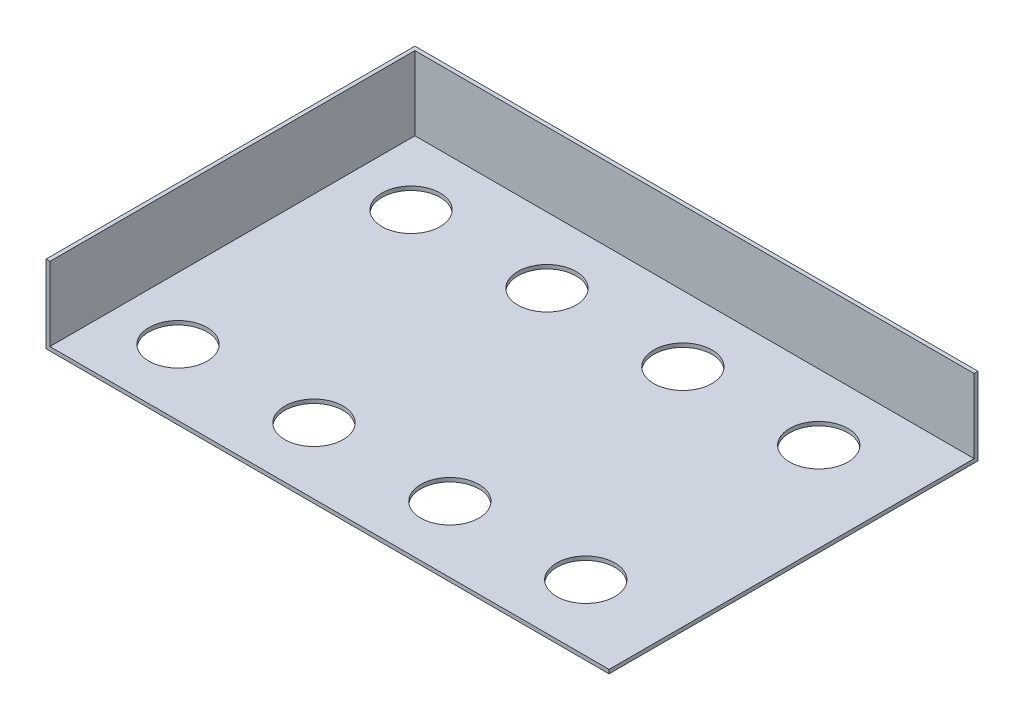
ISO-10303-21;
HEADER;
FILE_DESCRIPTION(('STEP AP214'),'2;1');
FILE_NAME('part.step','',(''),(''),'','','');
FILE_SCHEMA(('AUTOMOTIVE_DESIGN { 1 0 10303 214 1 1 1 1 }'));
ENDSEC;
DATA;
#1=APPLICATION_CONTEXT('core data for automotive mechanical design processes');
#2=APPLICATION_PROTOCOL_DEFINITION('international standard','automotive_design',2000,#1);
#3=PRODUCT_CONTEXT('',#1,'mechanical');
#4=PRODUCT('Part','Part','',(#3));
#5=PRODUCT_RELATED_PRODUCT_CATEGORY('part','',(#4));
#6=PRODUCT_DEFINITION_FORMATION('','',#4);
#7=PRODUCT_DEFINITION_CONTEXT('part definition',#1,'design');
#8=PRODUCT_DEFINITION('design','',#6,#7);
#9=PRODUCT_DEFINITION_SHAPE('','',#8);
#10=(LENGTH_UNIT() NAMED_UNIT(*) SI_UNIT(.MILLI.,.METRE.));
#11=(NAMED_UNIT(*) PLANE_ANGLE_UNIT() SI_UNIT($,.RADIAN.));
#12=(NAMED_UNIT(*) SI_UNIT($,.STERADIAN.) SOLID_ANGLE_UNIT());
#13=UNCERTAINTY_MEASURE_WITH_UNIT(LENGTH_MEASURE(1.E-05),#10,'distance_accuracy_value','');
#14=(GEOMETRIC_REPRESENTATION_CONTEXT(3) GLOBAL_UNCERTAINTY_ASSIGNED_CONTEXT((#13)) GLOBAL_UNIT_ASSIGNED_CONTEXT((#10,
#11,#12)) REPRESENTATION_CONTEXT('',''));
#15=CARTESIAN_POINT('',(0.,0.,0.));
#16=DIRECTION('',(0.,0.,1.));
#17=DIRECTION('',(1.,0.,0.));
#18=AXIS2_PLACEMENT_3D('',#15,#16,#17);
#19=CARTESIAN_POINT('',(-72.5,20.,47.5));
#20=DIRECTION('',(0.,0.,-1.));
#21=DIRECTION('',(-1.,0.,0.));
#22=AXIS2_PLACEMENT_3D('',#19,#20,#21);
#23=PLANE('',#22);
#24=DIRECTION('',(1.,0.,0.));
#25=VECTOR('',#24,1.);
#26=CARTESIAN_POINT('',(-72.5,1.,47.5));
#27=LINE('',#26,#25);
#28=CARTESIAN_POINT('',(-71.5,1.,47.5));
#29=VERTEX_POINT('',#28);
#30=CARTESIAN_POINT('',(72.5,1.,47.5));
#31=VERTEX_POINT('',#30);
#32=EDGE_CURVE('E122',#29,#31,#27,.T.);
#33=ORIENTED_EDGE('',*,*,#32,.F.);
#34=DIRECTION('',(0.,-1.,0.));
#35=VECTOR('',#34,1.);
#36=CARTESIAN_POINT('',(-71.5,20.,47.5));
#37=LINE('',#36,#35);
#38=CARTESIAN_POINT('',(-71.5,20.,47.5));
#39=VERTEX_POINT('',#38);
#40=EDGE_CURVE('E121',#39,#29,#37,.T.);
#41=ORIENTED_EDGE('',*,*,#40,.F.);
#42=DIRECTION('',(1.,0.,0.));
#43=VECTOR('',#42,1.);
#44=CARTESIAN_POINT('',(-72.5,20.,47.5));
#45=LINE('',#44,#43);
#46=CARTESIAN_POINT('',(-72.5,20.,47.5));
#47=VERTEX_POINT('',#46);
#48=EDGE_CURVE('E84',#47,#39,#45,.T.);
#49=ORIENTED_EDGE('',*,*,#48,.F.);
#50=DIRECTION('',(0.,-1.,0.));
#51=VECTOR('',#50,1.);
#52=CARTESIAN_POINT('',(-72.5,20.,47.5));
#53=LINE('',#52,#51);
#54=CARTESIAN_POINT('',(-72.5,0.,47.5));
#55=VERTEX_POINT('',#54);
#56=EDGE_CURVE('E11',#47,#55,#53,.T.);
#57=ORIENTED_EDGE('',*,*,#56,.T.);
#58=DIRECTION('',(1.,0.,0.));
#59=VECTOR('',#58,1.);
#60=CARTESIAN_POINT('',(-72.5,0.,47.5));
#61=LINE('',#60,#59);
#62=CARTESIAN_POINT('',(72.5,0.,47.5));
#63=VERTEX_POINT('',#62);
#64=EDGE_CURVE('E147',#55,#63,#61,.T.);
#65=ORIENTED_EDGE('',*,*,#64,.T.);
#66=DIRECTION('',(0.,-1.,0.));
#67=VECTOR('',#66,1.);
#68=CARTESIAN_POINT('',(72.5,20.,47.5));
#69=LINE('',#68,#67);
#70=EDGE_CURVE('E41',#31,#63,#69,.T.);
#71=ORIENTED_EDGE('',*,*,#70,.F.);
#72=EDGE_LOOP('',(#33,#41,#49,#57,#65,#71));
#73=FACE_BOUND('',#72,.T.);
#74=ADVANCED_FACE('F32',(#73),#23,.F.);
#75=CARTESIAN_POINT('',(72.5,20.,-47.5));
#76=DIRECTION('',(-1.,0.,0.));
#77=DIRECTION('',(0.,0.,1.));
#78=AXIS2_PLACEMENT_3D('',#75,#76,#77);
#79=PLANE('',#78);
#80=DIRECTION('',(0.,0.,-1.));
#81=VECTOR('',#80,1.);
#82=CARTESIAN_POINT('',(72.5,1.,-47.5));
#83=LINE('',#82,#81);
#84=CARTESIAN_POINT('',(72.5,1.,-46.5));
#85=VERTEX_POINT('',#84);
#86=EDGE_CURVE('E110',#31,#85,#83,.T.);
#87=ORIENTED_EDGE('',*,*,#86,.F.);
#88=ORIENTED_EDGE('',*,*,#70,.T.);
#89=DIRECTION('',(0.,0.,-1.));
#90=VECTOR('',#89,1.);
#91=CARTESIAN_POINT('',(72.5,0.,-47.5));
#92=LINE('',#91,#90);
#93=CARTESIAN_POINT('',(72.5,0.,-47.5));
#94=VERTEX_POINT('',#93);
#95=EDGE_CURVE('E150',#63,#94,#92,.T.);
#96=ORIENTED_EDGE('',*,*,#95,.T.);
#97=DIRECTION('',(0.,-1.,0.));
#98=VECTOR('',#97,1.);
#99=CARTESIAN_POINT('',(72.5,20.,-47.5));
#100=LINE('',#99,#98);
#101=CARTESIAN_POINT('',(72.5,20.,-47.5));
#102=VERTEX_POINT('',#101);
#103=EDGE_CURVE('E154',#102,#94,#100,.T.);
#104=ORIENTED_EDGE('',*,*,#103,.F.);
#105=DIRECTION('',(0.,0.,-1.));
#106=VECTOR('',#105,1.);
#107=CARTESIAN_POINT('',(72.5,20.,-47.5));
#108=LINE('',#107,#106);
#109=CARTESIAN_POINT('',(72.5,20.,-46.5));
#110=VERTEX_POINT('',#109);
#111=EDGE_CURVE('E141',#110,#102,#108,.T.);
#112=ORIENTED_EDGE('',*,*,#111,.F.);
#113=DIRECTION('',(0.,-1.,0.));
#114=VECTOR('',#113,1.);
#115=CARTESIAN_POINT('',(72.5,20.,-46.5));
#116=LINE('',#115,#114);
#117=EDGE_CURVE('E49',#110,#85,#116,.T.);
#118=ORIENTED_EDGE('',*,*,#117,.T.);
#119=EDGE_LOOP('',(#87,#88,#96,#104,#112,#118));
#120=FACE_BOUND('',#119,.T.);
#121=ADVANCED_FACE('F218',(#120),#79,.F.);
#122=CARTESIAN_POINT('',(-72.5,20.,-47.5));
#123=DIRECTION('',(1.,0.,0.));
#124=DIRECTION('',(0.,0.,-1.));
#125=AXIS2_PLACEMENT_3D('',#122,#123,#124);
#126=PLANE('',#125);
#127=DIRECTION('',(0.,0.,1.));
#128=VECTOR('',#127,1.);
#129=CARTESIAN_POINT('',(-72.5,0.,-47.5));
#130=LINE('',#129,#128);
#131=CARTESIAN_POINT('',(-72.5,0.,-47.5));
#132=VERTEX_POINT('',#131);
#133=EDGE_CURVE('E132',#132,#55,#130,.T.);
#134=ORIENTED_EDGE('',*,*,#133,.T.);
#135=ORIENTED_EDGE('',*,*,#56,.F.);
#136=DIRECTION('',(0.,0.,1.));
#137=VECTOR('',#136,1.);
#138=CARTESIAN_POINT('',(-72.5,20.,-47.5));
#139=LINE('',#138,#137);
#140=CARTESIAN_POINT('',(-72.5,20.,-47.5));
#141=VERTEX_POINT('',#140);
#142=EDGE_CURVE('E138',#141,#47,#139,.T.);
#143=ORIENTED_EDGE('',*,*,#142,.F.);
#144=DIRECTION('',(0.,-1.,0.));
#145=VECTOR('',#144,1.);
#146=CARTESIAN_POINT('',(-72.5,20.,-47.5));
#147=LINE('',#146,#145);
#148=EDGE_CURVE('E144',#141,#132,#147,.T.);
#149=ORIENTED_EDGE('',*,*,#148,.T.);
#150=EDGE_LOOP('',(#134,#135,#143,#149));
#151=FACE_BOUND('',#150,.T.);
#152=ADVANCED_FACE('F34',(#151),#126,.F.);
#153=CARTESIAN_POINT('',(-72.5,20.,-47.5));
#154=DIRECTION('',(0.,0.,1.));
#155=DIRECTION('',(1.,0.,0.));
#156=AXIS2_PLACEMENT_3D('',#153,#154,#155);
#157=PLANE('',#156);
#158=DIRECTION('',(-1.,0.,0.));
#159=VECTOR('',#158,1.);
#160=CARTESIAN_POINT('',(-72.5,0.,-47.5));
#161=LINE('',#160,#159);
#162=EDGE_CURVE('E78',#94,#132,#161,.T.);
#163=ORIENTED_EDGE('',*,*,#162,.T.);
#164=ORIENTED_EDGE('',*,*,#148,.F.);
#165=DIRECTION('',(-1.,0.,0.));
#166=VECTOR('',#165,1.);
#167=CARTESIAN_POINT('',(-72.5,20.,-47.5));
#168=LINE('',#167,#166);
#169=EDGE_CURVE('E58',#102,#141,#168,.T.);
#170=ORIENTED_EDGE('',*,*,#169,.F.);
#171=ORIENTED_EDGE('',*,*,#103,.T.);
#172=EDGE_LOOP('',(#163,#164,#170,#171));
#173=FACE_BOUND('',#172,.T.);
#174=ADVANCED_FACE('F225',(#173),#157,.F.);
#175=CARTESIAN_POINT('',(-72.5,20.,47.5));
#176=DIRECTION('',(0.,1.,0.));
#177=DIRECTION('',(0.,0.,1.));
#178=AXIS2_PLACEMENT_3D('',#175,#176,#177);
#179=PLANE('',#178);
#180=DIRECTION('',(0.,0.,1.));
#181=VECTOR('',#180,1.);
#182=CARTESIAN_POINT('',(-71.5,20.,-47.5));
#183=LINE('',#182,#181);
#184=CARTESIAN_POINT('',(-71.5,20.,-46.5));
#185=VERTEX_POINT('',#184);
#186=EDGE_CURVE('E111',#185,#39,#183,.T.);
#187=ORIENTED_EDGE('',*,*,#186,.F.);
#188=DIRECTION('',(-1.,0.,0.));
#189=VECTOR('',#188,1.);
#190=CARTESIAN_POINT('',(-72.5,20.,-46.5));
#191=LINE('',#190,#189);
#192=EDGE_CURVE('E116',#110,#185,#191,.T.);
#193=ORIENTED_EDGE('',*,*,#192,.F.);
#194=ORIENTED_EDGE('',*,*,#111,.T.);
#195=ORIENTED_EDGE('',*,*,#169,.T.);
#196=ORIENTED_EDGE('',*,*,#142,.T.);
#197=ORIENTED_EDGE('',*,*,#48,.T.);
#198=EDGE_LOOP('',(#187,#193,#194,#195,#196,#197));
#199=FACE_BOUND('',#198,.T.);
#200=ADVANCED_FACE('F228',(#199),#179,.T.);
#201=CARTESIAN_POINT('',(-72.5,0.,47.5));
#202=DIRECTION('',(0.,1.,0.));
#203=DIRECTION('',(0.,0.,1.));
#204=AXIS2_PLACEMENT_3D('',#201,#202,#203);
#205=PLANE('',#204);
#206=CARTESIAN_POINT('',(49.5,0.,-29.5));
#207=DIRECTION('',(0.,1.,0.));
#208=DIRECTION('',(0.,0.,1.));
#209=AXIS2_PLACEMENT_3D('',#206,#207,#208);
#210=CIRCLE('',#209,7.5);
#211=CARTESIAN_POINT('',(49.5,0.,-22.));
#212=VERTEX_POINT('',#211);
#213=EDGE_CURVE('E188',#212,#212,#210,.T.);
#214=ORIENTED_EDGE('',*,*,#213,.T.);
#215=EDGE_LOOP('',(#214));
#216=FACE_BOUND('',#215,.T.);
#217=CARTESIAN_POINT('',(49.5,0.,30.5));
#218=DIRECTION('',(0.,1.,0.));
#219=DIRECTION('',(0.,0.,1.));
#220=AXIS2_PLACEMENT_3D('',#217,#218,#219);
#221=CIRCLE('',#220,7.5);
#222=CARTESIAN_POINT('',(49.5,0.,38.));
#223=VERTEX_POINT('',#222);
#224=EDGE_CURVE('E178',#223,#223,#221,.T.);
#225=ORIENTED_EDGE('',*,*,#224,.T.);
#226=EDGE_LOOP('',(#225));
#227=FACE_BOUND('',#226,.T.);
#228=CARTESIAN_POINT('',(14.5,0.,-29.5));
#229=DIRECTION('',(0.,1.,0.));
#230=DIRECTION('',(0.,0.,1.));
#231=AXIS2_PLACEMENT_3D('',#228,#229,#230);
#232=CIRCLE('',#231,7.5);
#233=CARTESIAN_POINT('',(14.5,0.,-22.));
#234=VERTEX_POINT('',#233);
#235=EDGE_CURVE('E175',#234,#234,#232,.T.);
#236=ORIENTED_EDGE('',*,*,#235,.T.);
#237=EDGE_LOOP('',(#236));
#238=FACE_BOUND('',#237,.T.);
#239=CARTESIAN_POINT('',(14.5,0.,30.5));
#240=DIRECTION('',(0.,1.,0.));
#241=DIRECTION('',(0.,0.,1.));
#242=AXIS2_PLACEMENT_3D('',#239,#240,#241);
#243=CIRCLE('',#242,7.5);
#244=CARTESIAN_POINT('',(14.5,0.,38.));
#245=VERTEX_POINT('',#244);
#246=EDGE_CURVE('E172',#245,#245,#243,.T.);
#247=ORIENTED_EDGE('',*,*,#246,.T.);
#248=EDGE_LOOP('',(#247));
#249=FACE_BOUND('',#248,.T.);
#250=CARTESIAN_POINT('',(-20.5,0.,-29.5));
#251=DIRECTION('',(0.,1.,0.));
#252=DIRECTION('',(0.,0.,1.));
#253=AXIS2_PLACEMENT_3D('',#250,#251,#252);
#254=CIRCLE('',#253,7.5);
#255=CARTESIAN_POINT('',(-20.5,0.,-22.));
#256=VERTEX_POINT('',#255);
#257=EDGE_CURVE('E168',#256,#256,#254,.T.);
#258=ORIENTED_EDGE('',*,*,#257,.T.);
#259=EDGE_LOOP('',(#258));
#260=FACE_BOUND('',#259,.T.);
#261=CARTESIAN_POINT('',(-20.5,0.,30.5));
#262=DIRECTION('',(0.,1.,0.));
#263=DIRECTION('',(0.,0.,1.));
#264=AXIS2_PLACEMENT_3D('',#261,#262,#263);
#265=CIRCLE('',#264,7.5);
#266=CARTESIAN_POINT('',(-20.5,0.,38.));
#267=VERTEX_POINT('',#266);
#268=EDGE_CURVE('E164',#267,#267,#265,.T.);
#269=ORIENTED_EDGE('',*,*,#268,.T.);
#270=EDGE_LOOP('',(#269));
#271=FACE_BOUND('',#270,.T.);
#272=CARTESIAN_POINT('',(-55.5,0.,-29.5));
#273=DIRECTION('',(0.,1.,0.));
#274=DIRECTION('',(0.,0.,1.));
#275=AXIS2_PLACEMENT_3D('',#272,#273,#274);
#276=CIRCLE('',#275,7.5);
#277=CARTESIAN_POINT('',(-55.5,0.,-22.));
#278=VERTEX_POINT('',#277);
#279=EDGE_CURVE('E160',#278,#278,#276,.T.);
#280=ORIENTED_EDGE('',*,*,#279,.T.);
#281=EDGE_LOOP('',(#280));
#282=FACE_BOUND('',#281,.T.);
#283=CARTESIAN_POINT('',(-55.5,0.,30.5));
#284=DIRECTION('',(0.,1.,0.));
#285=DIRECTION('',(0.,0.,1.));
#286=AXIS2_PLACEMENT_3D('',#283,#284,#285);
#287=CIRCLE('',#286,7.5);
#288=CARTESIAN_POINT('',(-55.5,0.,38.));
#289=VERTEX_POINT('',#288);
#290=EDGE_CURVE('E127',#289,#289,#287,.T.);
#291=ORIENTED_EDGE('',*,*,#290,.T.);
#292=EDGE_LOOP('',(#291));
#293=FACE_BOUND('',#292,.T.);
#294=ORIENTED_EDGE('',*,*,#133,.F.);
#295=ORIENTED_EDGE('',*,*,#162,.F.);
#296=ORIENTED_EDGE('',*,*,#95,.F.);
#297=ORIENTED_EDGE('',*,*,#64,.F.);
#298=EDGE_LOOP('',(#294,#295,#296,#297));
#299=FACE_BOUND('',#298,.T.);
#300=ADVANCED_FACE('F199',(#216,#227,#238,#249,#260,#271,#282,#293,#299),#205,.F.);
#301=CARTESIAN_POINT('',(-71.5,20.,-47.5));
#302=DIRECTION('',(1.,0.,0.));
#303=DIRECTION('',(0.,0.,-1.));
#304=AXIS2_PLACEMENT_3D('',#301,#302,#303);
#305=PLANE('',#304);
#306=DIRECTION('',(0.,0.,1.));
#307=VECTOR('',#306,1.);
#308=CARTESIAN_POINT('',(-71.5,1.,-47.5));
#309=LINE('',#308,#307);
#310=CARTESIAN_POINT('',(-71.5,1.,-46.5));
#311=VERTEX_POINT('',#310);
#312=EDGE_CURVE('E107',#311,#29,#309,.T.);
#313=ORIENTED_EDGE('',*,*,#312,.F.);
#314=DIRECTION('',(0.,-1.,0.));
#315=VECTOR('',#314,1.);
#316=CARTESIAN_POINT('',(-71.5,20.,-46.5));
#317=LINE('',#316,#315);
#318=EDGE_CURVE('E114',#185,#311,#317,.T.);
#319=ORIENTED_EDGE('',*,*,#318,.F.);
#320=ORIENTED_EDGE('',*,*,#186,.T.);
#321=ORIENTED_EDGE('',*,*,#40,.T.);
#322=EDGE_LOOP('',(#313,#319,#320,#321));
#323=FACE_BOUND('',#322,.T.);
#324=ADVANCED_FACE('F120',(#323),#305,.T.);
#325=CARTESIAN_POINT('',(-72.5,20.,-46.5));
#326=DIRECTION('',(0.,0.,1.));
#327=DIRECTION('',(1.,0.,0.));
#328=AXIS2_PLACEMENT_3D('',#325,#326,#327);
#329=PLANE('',#328);
#330=DIRECTION('',(-1.,0.,0.));
#331=VECTOR('',#330,1.);
#332=CARTESIAN_POINT('',(-72.5,1.,-46.5));
#333=LINE('',#332,#331);
#334=EDGE_CURVE('E103',#85,#311,#333,.T.);
#335=ORIENTED_EDGE('',*,*,#334,.F.);
#336=ORIENTED_EDGE('',*,*,#117,.F.);
#337=ORIENTED_EDGE('',*,*,#192,.T.);
#338=ORIENTED_EDGE('',*,*,#318,.T.);
#339=EDGE_LOOP('',(#335,#336,#337,#338));
#340=FACE_BOUND('',#339,.T.);
#341=ADVANCED_FACE('F115',(#340),#329,.T.);
#342=CARTESIAN_POINT('',(-72.5,1.,47.5));
#343=DIRECTION('',(0.,1.,0.));
#344=DIRECTION('',(0.,0.,1.));
#345=AXIS2_PLACEMENT_3D('',#342,#343,#344);
#346=PLANE('',#345);
#347=CARTESIAN_POINT('',(49.5,1.,-29.5));
#348=DIRECTION('',(0.,1.,0.));
#349=DIRECTION('',(0.,0.,1.));
#350=AXIS2_PLACEMENT_3D('',#347,#348,#349);
#351=CIRCLE('',#350,7.5);
#352=CARTESIAN_POINT('',(49.5,1.,-22.));
#353=VERTEX_POINT('',#352);
#354=EDGE_CURVE('E36',#353,#353,#351,.T.);
#355=ORIENTED_EDGE('',*,*,#354,.F.);
#356=EDGE_LOOP('',(#355));
#357=FACE_BOUND('',#356,.T.);
#358=CARTESIAN_POINT('',(49.5,1.,30.5));
#359=DIRECTION('',(0.,1.,0.));
#360=DIRECTION('',(0.,0.,1.));
#361=AXIS2_PLACEMENT_3D('',#358,#359,#360);
#362=CIRCLE('',#361,7.5);
#363=CARTESIAN_POINT('',(49.5,1.,38.));
#364=VERTEX_POINT('',#363);
#365=EDGE_CURVE('E176',#364,#364,#362,.T.);
#366=ORIENTED_EDGE('',*,*,#365,.F.);
#367=EDGE_LOOP('',(#366));
#368=FACE_BOUND('',#367,.T.);
#369=CARTESIAN_POINT('',(14.5,1.,-29.5));
#370=DIRECTION('',(0.,1.,0.));
#371=DIRECTION('',(0.,0.,1.));
#372=AXIS2_PLACEMENT_3D('',#369,#370,#371);
#373=CIRCLE('',#372,7.5);
#374=CARTESIAN_POINT('',(14.5,1.,-22.));
#375=VERTEX_POINT('',#374);
#376=EDGE_CURVE('E173',#375,#375,#373,.T.);
#377=ORIENTED_EDGE('',*,*,#376,.F.);
#378=EDGE_LOOP('',(#377));
#379=FACE_BOUND('',#378,.T.);
#380=CARTESIAN_POINT('',(14.5,1.,30.5));
#381=DIRECTION('',(0.,1.,0.));
#382=DIRECTION('',(0.,0.,1.));
#383=AXIS2_PLACEMENT_3D('',#380,#381,#382);
#384=CIRCLE('',#383,7.5);
#385=CARTESIAN_POINT('',(14.5,1.,38.));
#386=VERTEX_POINT('',#385);
#387=EDGE_CURVE('E169',#386,#386,#384,.T.);
#388=ORIENTED_EDGE('',*,*,#387,.F.);
#389=EDGE_LOOP('',(#388));
#390=FACE_BOUND('',#389,.T.);
#391=CARTESIAN_POINT('',(-20.5,1.,-29.5));
#392=DIRECTION('',(0.,1.,0.));
#393=DIRECTION('',(0.,0.,1.));
#394=AXIS2_PLACEMENT_3D('',#391,#392,#393);
#395=CIRCLE('',#394,7.5);
#396=CARTESIAN_POINT('',(-20.5,1.,-22.));
#397=VERTEX_POINT('',#396);
#398=EDGE_CURVE('E165',#397,#397,#395,.T.);
#399=ORIENTED_EDGE('',*,*,#398,.F.);
#400=EDGE_LOOP('',(#399));
#401=FACE_BOUND('',#400,.T.);
#402=CARTESIAN_POINT('',(-20.5,1.,30.5));
#403=DIRECTION('',(0.,1.,0.));
#404=DIRECTION('',(0.,0.,1.));
#405=AXIS2_PLACEMENT_3D('',#402,#403,#404);
#406=CIRCLE('',#405,7.5);
#407=CARTESIAN_POINT('',(-20.5,1.,38.));
#408=VERTEX_POINT('',#407);
#409=EDGE_CURVE('E161',#408,#408,#406,.T.);
#410=ORIENTED_EDGE('',*,*,#409,.F.);
#411=EDGE_LOOP('',(#410));
#412=FACE_BOUND('',#411,.T.);
#413=CARTESIAN_POINT('',(-55.5,1.,-29.5));
#414=DIRECTION('',(0.,1.,0.));
#415=DIRECTION('',(0.,0.,1.));
#416=AXIS2_PLACEMENT_3D('',#413,#414,#415);
#417=CIRCLE('',#416,7.5);
#418=CARTESIAN_POINT('',(-55.5,1.,-22.));
#419=VERTEX_POINT('',#418);
#420=EDGE_CURVE('E157',#419,#419,#417,.T.);
#421=ORIENTED_EDGE('',*,*,#420,.F.);
#422=EDGE_LOOP('',(#421));
#423=FACE_BOUND('',#422,.T.);
#424=CARTESIAN_POINT('',(-55.5,1.,30.5));
#425=DIRECTION('',(0.,1.,0.));
#426=DIRECTION('',(0.,0.,1.));
#427=AXIS2_PLACEMENT_3D('',#424,#425,#426);
#428=CIRCLE('',#427,7.5);
#429=CARTESIAN_POINT('',(-55.5,1.,38.));
#430=VERTEX_POINT('',#429);
#431=EDGE_CURVE('E123',#430,#430,#428,.T.);
#432=ORIENTED_EDGE('',*,*,#431,.F.);
#433=EDGE_LOOP('',(#432));
#434=FACE_BOUND('',#433,.T.);
#435=ORIENTED_EDGE('',*,*,#312,.T.);
#436=ORIENTED_EDGE('',*,*,#32,.T.);
#437=ORIENTED_EDGE('',*,*,#86,.T.);
#438=ORIENTED_EDGE('',*,*,#334,.T.);
#439=EDGE_LOOP('',(#435,#436,#437,#438));
#440=FACE_BOUND('',#439,.T.);
#441=ADVANCED_FACE('F105',(#357,#368,#379,#390,#401,#412,#423,#434,#440),#346,.T.);
#442=CARTESIAN_POINT('',(-55.5,0.,30.5));
#443=DIRECTION('',(0.,1.,0.));
#444=DIRECTION('',(0.,0.,1.));
#445=AXIS2_PLACEMENT_3D('',#442,#443,#444);
#446=CYLINDRICAL_SURFACE('',#445,7.5);
#447=ORIENTED_EDGE('',*,*,#431,.T.);
#448=EDGE_LOOP('',(#447));
#449=FACE_BOUND('',#448,.T.);
#450=ORIENTED_EDGE('',*,*,#290,.F.);
#451=EDGE_LOOP('',(#450));
#452=FACE_BOUND('',#451,.T.);
#453=ADVANCED_FACE('F205',(#449,#452),#446,.F.);
#454=CARTESIAN_POINT('',(-55.5,0.,-29.5));
#455=DIRECTION('',(0.,1.,0.));
#456=DIRECTION('',(0.,0.,1.));
#457=AXIS2_PLACEMENT_3D('',#454,#455,#456);
#458=CYLINDRICAL_SURFACE('',#457,7.5);
#459=ORIENTED_EDGE('',*,*,#420,.T.);
#460=EDGE_LOOP('',(#459));
#461=FACE_BOUND('',#460,.T.);
#462=ORIENTED_EDGE('',*,*,#279,.F.);
#463=EDGE_LOOP('',(#462));
#464=FACE_BOUND('',#463,.T.);
#465=ADVANCED_FACE('F202',(#461,#464),#458,.F.);
#466=CARTESIAN_POINT('',(-20.5,0.,30.5));
#467=DIRECTION('',(0.,1.,0.));
#468=DIRECTION('',(0.,0.,1.));
#469=AXIS2_PLACEMENT_3D('',#466,#467,#468);
#470=CYLINDRICAL_SURFACE('',#469,7.5);
#471=ORIENTED_EDGE('',*,*,#409,.T.);
#472=EDGE_LOOP('',(#471));
#473=FACE_BOUND('',#472,.T.);
#474=ORIENTED_EDGE('',*,*,#268,.F.);
#475=EDGE_LOOP('',(#474));
#476=FACE_BOUND('',#475,.T.);
#477=ADVANCED_FACE('F204',(#473,#476),#470,.F.);
#478=CARTESIAN_POINT('',(-20.5,0.,-29.5));
#479=DIRECTION('',(0.,1.,0.));
#480=DIRECTION('',(0.,0.,1.));
#481=AXIS2_PLACEMENT_3D('',#478,#479,#480);
#482=CYLINDRICAL_SURFACE('',#481,7.5);
#483=ORIENTED_EDGE('',*,*,#398,.T.);
#484=EDGE_LOOP('',(#483));
#485=FACE_BOUND('',#484,.T.);
#486=ORIENTED_EDGE('',*,*,#257,.F.);
#487=EDGE_LOOP('',(#486));
#488=FACE_BOUND('',#487,.T.);
#489=ADVANCED_FACE('F212',(#485,#488),#482,.F.);
#490=CARTESIAN_POINT('',(14.5,0.,30.5));
#491=DIRECTION('',(0.,1.,0.));
#492=DIRECTION('',(0.,0.,1.));
#493=AXIS2_PLACEMENT_3D('',#490,#491,#492);
#494=CYLINDRICAL_SURFACE('',#493,7.5);
#495=ORIENTED_EDGE('',*,*,#387,.T.);
#496=EDGE_LOOP('',(#495));
#497=FACE_BOUND('',#496,.T.);
#498=ORIENTED_EDGE('',*,*,#246,.F.);
#499=EDGE_LOOP('',(#498));
#500=FACE_BOUND('',#499,.T.);
#501=ADVANCED_FACE('F323',(#497,#500),#494,.F.);
#502=CARTESIAN_POINT('',(14.5,0.,-29.5));
#503=DIRECTION('',(0.,1.,0.));
#504=DIRECTION('',(0.,0.,1.));
#505=AXIS2_PLACEMENT_3D('',#502,#503,#504);
#506=CYLINDRICAL_SURFACE('',#505,7.5);
#507=ORIENTED_EDGE('',*,*,#376,.T.);
#508=EDGE_LOOP('',(#507));
#509=FACE_BOUND('',#508,.T.);
#510=ORIENTED_EDGE('',*,*,#235,.F.);
#511=EDGE_LOOP('',(#510));
#512=FACE_BOUND('',#511,.T.);
#513=ADVANCED_FACE('F332',(#509,#512),#506,.F.);
#514=CARTESIAN_POINT('',(49.5,0.,30.5));
#515=DIRECTION('',(0.,1.,0.));
#516=DIRECTION('',(0.,0.,1.));
#517=AXIS2_PLACEMENT_3D('',#514,#515,#516);
#518=CYLINDRICAL_SURFACE('',#517,7.5);
#519=ORIENTED_EDGE('',*,*,#365,.T.);
#520=EDGE_LOOP('',(#519));
#521=FACE_BOUND('',#520,.T.);
#522=ORIENTED_EDGE('',*,*,#224,.F.);
#523=EDGE_LOOP('',(#522));
#524=FACE_BOUND('',#523,.T.);
#525=ADVANCED_FACE('F341',(#521,#524),#518,.F.);
#526=CARTESIAN_POINT('',(49.5,0.,-29.5));
#527=DIRECTION('',(0.,1.,0.));
#528=DIRECTION('',(0.,0.,1.));
#529=AXIS2_PLACEMENT_3D('',#526,#527,#528);
#530=CYLINDRICAL_SURFACE('',#529,7.5);
#531=ORIENTED_EDGE('',*,*,#354,.T.);
#532=EDGE_LOOP('',(#531));
#533=FACE_BOUND('',#532,.T.);
#534=ORIENTED_EDGE('',*,*,#213,.F.);
#535=EDGE_LOOP('',(#534));
#536=FACE_BOUND('',#535,.T.);
#537=ADVANCED_FACE('F350',(#533,#536),#530,.F.);
#538=CLOSED_SHELL('',(#74,#121,#152,#174,#200,#300,#324,#341,#441,#453,#465,#477,#489,#501,#513,
#525,#537));
#539=MANIFOLD_SOLID_BREP('B2',#538);
#540=ADVANCED_BREP_SHAPE_REPRESENTATION('',(#18,#539),#14);
#541=SHAPE_DEFINITION_REPRESENTATION(#9,#540);
ENDSEC;
END-ISO-10303-21;
